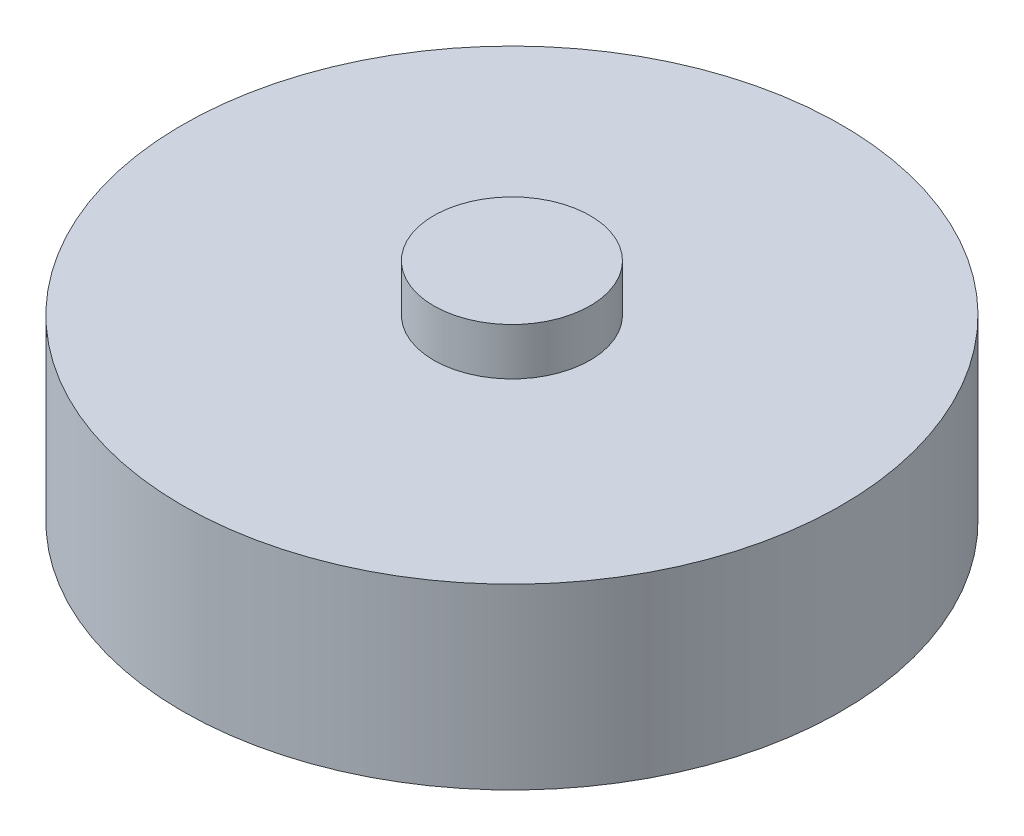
ISO-10303-21;
HEADER;
FILE_DESCRIPTION(('STEP AP214'),'2;1');
FILE_NAME('part.step','',(''),(''),'','','');
FILE_SCHEMA(('AUTOMOTIVE_DESIGN { 1 0 10303 214 1 1 1 1 }'));
ENDSEC;
DATA;
#1=APPLICATION_CONTEXT('core data for automotive mechanical design processes');
#2=APPLICATION_PROTOCOL_DEFINITION('international standard','automotive_design',2000,#1);
#3=PRODUCT_CONTEXT('',#1,'mechanical');
#4=PRODUCT('Part','Part','',(#3));
#5=PRODUCT_RELATED_PRODUCT_CATEGORY('part','',(#4));
#6=PRODUCT_DEFINITION_FORMATION('','',#4);
#7=PRODUCT_DEFINITION_CONTEXT('part definition',#1,'design');
#8=PRODUCT_DEFINITION('design','',#6,#7);
#9=PRODUCT_DEFINITION_SHAPE('','',#8);
#10=(LENGTH_UNIT() NAMED_UNIT(*) SI_UNIT(.MILLI.,.METRE.));
#11=(NAMED_UNIT(*) PLANE_ANGLE_UNIT() SI_UNIT($,.RADIAN.));
#12=(NAMED_UNIT(*) SI_UNIT($,.STERADIAN.) SOLID_ANGLE_UNIT());
#13=UNCERTAINTY_MEASURE_WITH_UNIT(LENGTH_MEASURE(1.E-05),#10,'distance_accuracy_value','');
#14=(GEOMETRIC_REPRESENTATION_CONTEXT(3) GLOBAL_UNCERTAINTY_ASSIGNED_CONTEXT((#13)) GLOBAL_UNIT_ASSIGNED_CONTEXT((#10,
#11,#12)) REPRESENTATION_CONTEXT('',''));
#15=CARTESIAN_POINT('',(0.,0.,0.));
#16=DIRECTION('',(0.,0.,1.));
#17=DIRECTION('',(1.,0.,0.));
#18=AXIS2_PLACEMENT_3D('',#15,#16,#17);
#19=CARTESIAN_POINT('',(0.,2.61,0.));
#20=DIRECTION('',(0.,-1.,0.));
#21=DIRECTION('',(0.,0.,-1.));
#22=AXIS2_PLACEMENT_3D('',#19,#20,#21);
#23=CYLINDRICAL_SURFACE('',#22,4.826);
#24=CARTESIAN_POINT('',(0.,2.61,0.));
#25=DIRECTION('',(0.,1.,0.));
#26=DIRECTION('',(0.,0.,1.));
#27=AXIS2_PLACEMENT_3D('',#24,#25,#26);
#28=CIRCLE('',#27,4.826);
#29=CARTESIAN_POINT('',(0.,2.61,4.826));
#30=VERTEX_POINT('',#29);
#31=EDGE_CURVE('E10',#30,#30,#28,.T.);
#32=ORIENTED_EDGE('',*,*,#31,.F.);
#33=EDGE_LOOP('',(#32));
#34=FACE_BOUND('',#33,.T.);
#35=CARTESIAN_POINT('',(0.,0.,0.));
#36=DIRECTION('',(0.,1.,0.));
#37=DIRECTION('',(0.,0.,1.));
#38=AXIS2_PLACEMENT_3D('',#35,#36,#37);
#39=CIRCLE('',#38,4.826);
#40=CARTESIAN_POINT('',(0.,0.,4.826));
#41=VERTEX_POINT('',#40);
#42=EDGE_CURVE('E34',#41,#41,#39,.T.);
#43=ORIENTED_EDGE('',*,*,#42,.T.);
#44=EDGE_LOOP('',(#43));
#45=FACE_BOUND('',#44,.T.);
#46=ADVANCED_FACE('F31',(#34,#45),#23,.T.);
#47=CARTESIAN_POINT('',(0.,2.61,0.));
#48=DIRECTION('',(0.,1.,0.));
#49=DIRECTION('',(0.,0.,1.));
#50=AXIS2_PLACEMENT_3D('',#47,#48,#49);
#51=PLANE('',#50);
#52=CARTESIAN_POINT('',(0.,2.61,0.));
#53=DIRECTION('',(0.,1.,0.));
#54=DIRECTION('',(0.,0.,1.));
#55=AXIS2_PLACEMENT_3D('',#52,#53,#54);
#56=CIRCLE('',#55,1.145);
#57=CARTESIAN_POINT('',(0.,2.61,1.145));
#58=VERTEX_POINT('',#57);
#59=EDGE_CURVE('E43',#58,#58,#56,.T.);
#60=ORIENTED_EDGE('',*,*,#59,.F.);
#61=EDGE_LOOP('',(#60));
#62=FACE_BOUND('',#61,.T.);
#63=ORIENTED_EDGE('',*,*,#31,.T.);
#64=EDGE_LOOP('',(#63));
#65=FACE_BOUND('',#64,.T.);
#66=ADVANCED_FACE('F58',(#62,#65),#51,.T.);
#67=CARTESIAN_POINT('',(0.,0.,0.));
#68=DIRECTION('',(0.,1.,0.));
#69=DIRECTION('',(0.,0.,1.));
#70=AXIS2_PLACEMENT_3D('',#67,#68,#69);
#71=PLANE('',#70);
#72=ORIENTED_EDGE('',*,*,#42,.F.);
#73=EDGE_LOOP('',(#72));
#74=FACE_BOUND('',#73,.T.);
#75=ADVANCED_FACE('F54',(#74),#71,.F.);
#76=CARTESIAN_POINT('',(0.,3.3,0.));
#77=DIRECTION('',(0.,-1.,0.));
#78=DIRECTION('',(0.,0.,-1.));
#79=AXIS2_PLACEMENT_3D('',#76,#77,#78);
#80=CYLINDRICAL_SURFACE('',#79,1.145);
#81=CARTESIAN_POINT('',(0.,3.3,0.));
#82=DIRECTION('',(0.,1.,0.));
#83=DIRECTION('',(0.,0.,1.));
#84=AXIS2_PLACEMENT_3D('',#81,#82,#83);
#85=CIRCLE('',#84,1.145);
#86=CARTESIAN_POINT('',(0.,3.3,1.145));
#87=VERTEX_POINT('',#86);
#88=EDGE_CURVE('E41',#87,#87,#85,.T.);
#89=ORIENTED_EDGE('',*,*,#88,.F.);
#90=EDGE_LOOP('',(#89));
#91=FACE_BOUND('',#90,.T.);
#92=ORIENTED_EDGE('',*,*,#59,.T.);
#93=EDGE_LOOP('',(#92));
#94=FACE_BOUND('',#93,.T.);
#95=ADVANCED_FACE('F51',(#91,#94),#80,.T.);
#96=CARTESIAN_POINT('',(0.,3.3,0.));
#97=DIRECTION('',(0.,1.,0.));
#98=DIRECTION('',(0.,0.,1.));
#99=AXIS2_PLACEMENT_3D('',#96,#97,#98);
#100=PLANE('',#99);
#101=ORIENTED_EDGE('',*,*,#88,.T.);
#102=EDGE_LOOP('',(#101));
#103=FACE_BOUND('',#102,.T.);
#104=ADVANCED_FACE('F49',(#103),#100,.T.);
#105=CLOSED_SHELL('',(#46,#66,#75,#95,#104));
#106=MANIFOLD_SOLID_BREP('B2',#105);
#107=ADVANCED_BREP_SHAPE_REPRESENTATION('',(#18,#106),#14);
#108=SHAPE_DEFINITION_REPRESENTATION(#9,#107);
ENDSEC;
END-ISO-10303-21;
